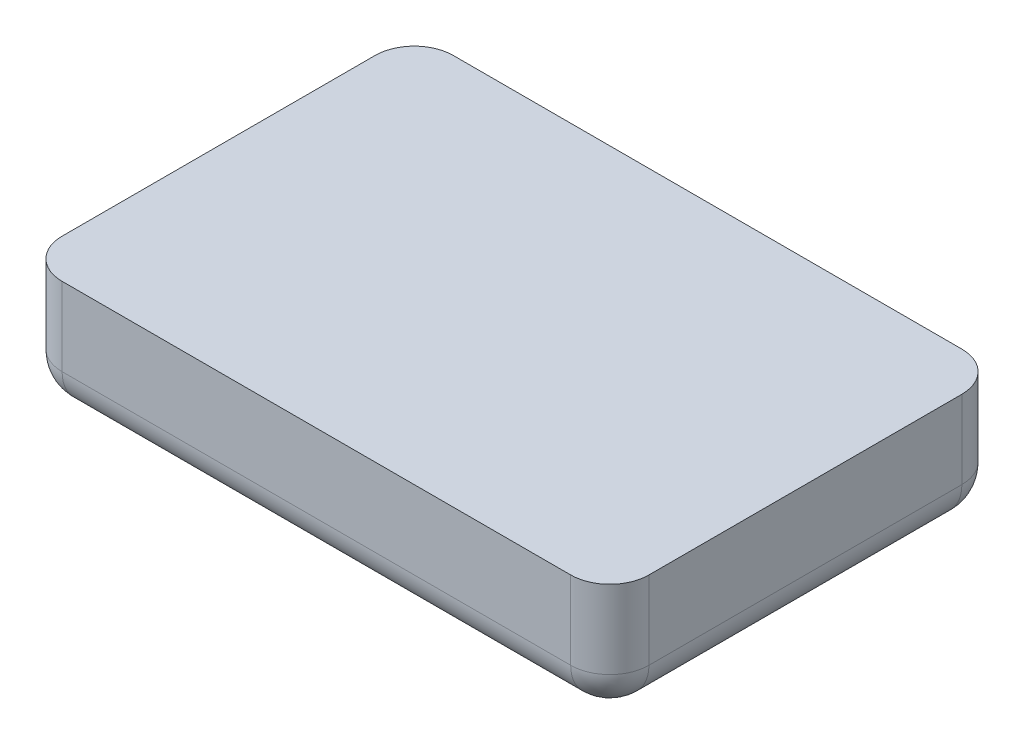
from build123d import *

# Parameters (mm, degrees)
SKETCH2_W      = 150
SKETCH2_H      = 100
EXTRUDE1_DEPTH = 30
FILLET1_R      = 10


with BuildPart() as part:
    # Sketch2 → Extrude1 (new body)
    with BuildSketch(Plane(origin=(0, 0, 0), x_dir=(1, 0, 0), z_dir=(0, 1, 0))):
        Rectangle(SKETCH2_W, SKETCH2_H)
    extrude(amount=EXTRUDE1_DEPTH)

    # Fillet1
    fillet1_edges = [part.edges().sort_by_distance(p)[0] for p in [
        (0, 0, -50),
        (75, 0, 0),
        (0, 0, 50),
        (-75, 0, 0),
        (-75, 15, -50),
        (75, 15, -50),
        (75, 15, 50),
        (-75, 15, 50),
    ]]
    fillet(fillet1_edges, radius=FILLET1_R)


solid = part.part
